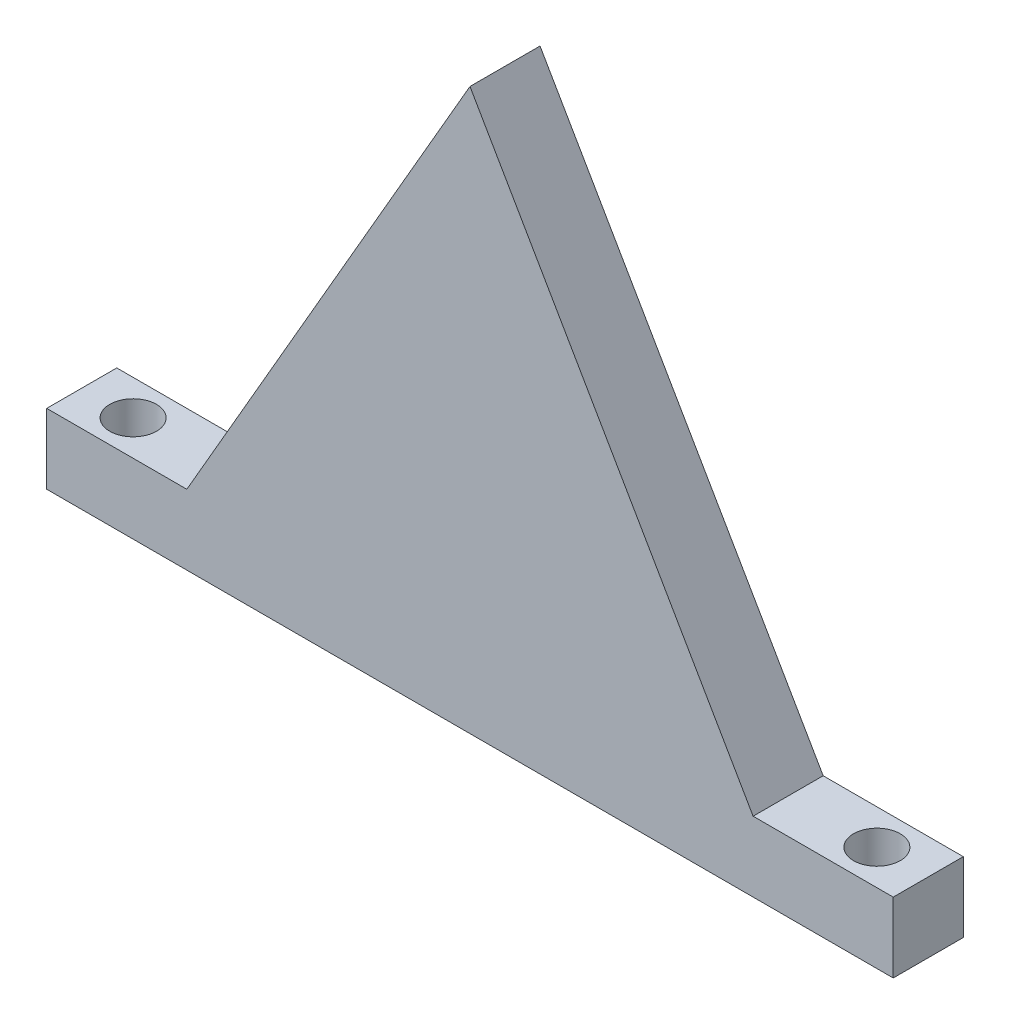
from build123d import *

# Parameters (mm, degrees)
BOSS_EXTRUDE1_DEPTH = 9.525
SKETCH4_R           = 6.35
CUT_EXTRUDE1_DEPTH  = 177.40458496


with BuildPart() as part:
    # Sketch2 → Boss-Extrude1 (new, symmetric)
    with BuildSketch(Plane.XY):
        Polygon((0, 0), (115.089658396, 0), (115.089658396, 19.05), (76.989658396, 19.05), (0, 152.4), align=None)
    boss_extrude1 = extrude(amount=BOSS_EXTRUDE1_DEPTH, both=True)

    # Sketch4 → Cut-Extrude1 (cut, through all)
    with BuildSketch(Plane(origin=(0, 19.05, 0), x_dir=(1, 0, 0), z_dir=(0, 1, 0))):
        with Locations(Location((101.119658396, 0, 0), (0, 0, 180))):
            Circle(SKETCH4_R)
    cut_extrude1 = extrude(amount=-CUT_EXTRUDE1_DEPTH, mode=Mode.SUBTRACT)

    # Mirror1: Boss-Extrude1, Cut-Extrude1 across plane
    add(boss_extrude1.mirror(Plane(origin=(0, 0, 0), x_dir=(0, 0, 1), z_dir=(1, 0, 0))))
    add(cut_extrude1.mirror(Plane(origin=(0, 0, 0), x_dir=(0, 0, 1), z_dir=(1, 0, 0))), mode=Mode.SUBTRACT)


solid = part.part
